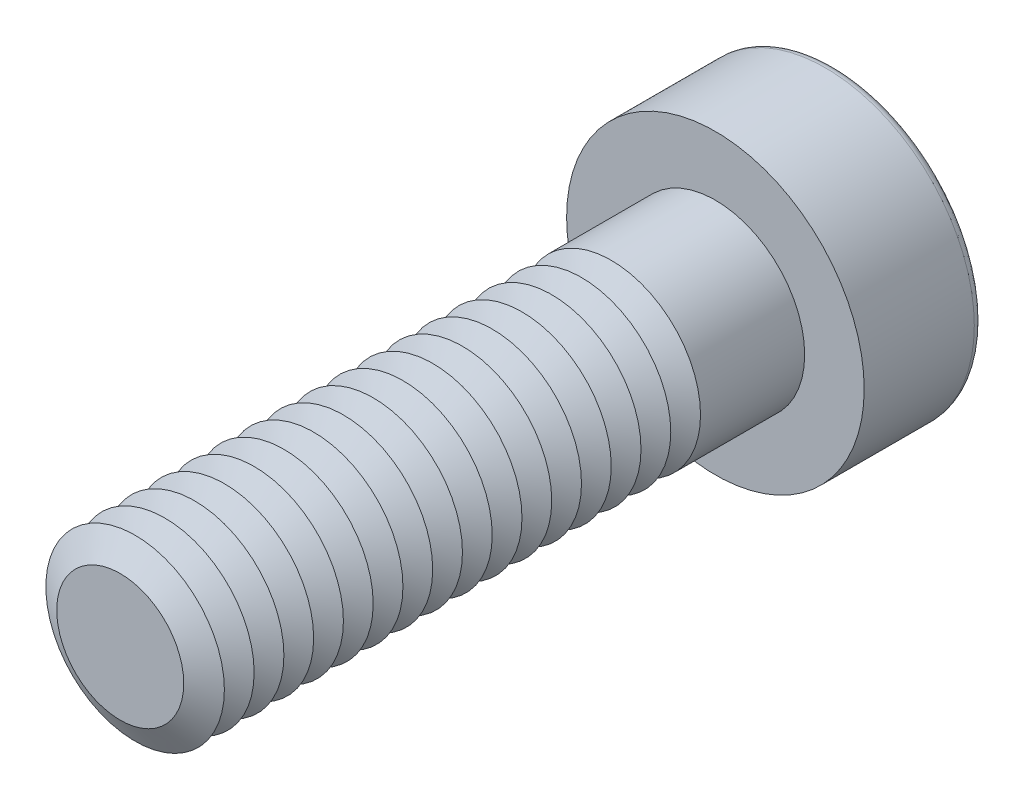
from build123d import *

# Parameters (mm, degrees)
SKETCH1_R           = 3
BOSS_EXTRUDE1_DEPTH = 20
SKETCH2_R           = 5
BOSS_EXTRUDE2_DEPTH = 4
CUT_EXTRUDE1_DEPTH  = 3
FILLET1_R           = 0.3
LPATTERN1_COUNT     = 17
LPATTERN1_PITCH     = 1


with BuildPart() as part:
    # Sketch1 → Boss-Extrude1 (new body)
    with BuildSketch(Plane.XY):
        Circle(SKETCH1_R)
    extrude(amount=BOSS_EXTRUDE1_DEPTH)

    # Sketch2 → Boss-Extrude2 (add)
    with BuildSketch(Plane(origin=(0, 0, 0), x_dir=(-1, 0, 0), z_dir=(0, 0, -1))):
        Circle(SKETCH2_R)
    extrude(amount=BOSS_EXTRUDE2_DEPTH)

    # Sketch3 → Cut-Extrude1 (cut)
    with BuildSketch(Plane(origin=(0, 0, -4), x_dir=(-1, 0, 0), z_dir=(0, 0, -1))):
        Polygon((-1.154700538, 2), (-2.309401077, 0), (-1.154700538, -2), (1.154700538, -2), (2.309401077, 0), (1.154700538, 2), align=None)
    extrude(amount=-CUT_EXTRUDE1_DEPTH, mode=Mode.SUBTRACT)

    # Fillet1
    fillet1_edges = [part.edges().sort_by_distance(p)[0] for p in [
        (5, 0, -4),
    ]]
    fillet(fillet1_edges, radius=FILLET1_R)

    # Cut-Extrude2 cone 1 section (on through the dimple's axis) → Cut-Extrude2 (revolve, cut)
    with BuildSketch(Plane(origin=(0, 0, -1), x_dir=(0, 1, 0), z_dir=(1, 0, 0))):
        Polygon((0, 0), (2, 0), (0, 1.154700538), align=None)
    revolve(axis=Axis((0, 0, -1), (0, 0, 1)), mode=Mode.SUBTRACT)

    # Cut-Extrude3 cone 1 section (on through the dimple's axis) → Cut-Extrude3 (revolve, cut)
    with BuildSketch(Plane(origin=(0, 0, -4), x_dir=(0, 1, 0), z_dir=(1, 0, 0))):
        Polygon((0, 0), (2.309401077, 0), (0, 0.618802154), align=None)
    revolve(axis=Axis((0, 0, -4), (0, 0, 1)), mode=Mode.SUBTRACT)

    # Sketch7 → Cut-Revolve1 (revolve, cut)
    with BuildSketch(Plane(origin=(0, 0, 0), x_dir=(0, 0, -1), z_dir=(1, 0, 0)), mode=Mode.PRIVATE) as cut_revolve1_sk:
        Polygon((-20, 2.133974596), (-19.5, 3), (-20.5, 3), align=None)
    cut_revolve1 = revolve(cut_revolve1_sk.sketch.rotate(Axis((0, 0, 20), (0, 0, -1)), 90), axis=Axis((0, 0, 20), (0, 0, -1)), mode=Mode.SUBTRACT)

    # LPattern1: Cut-Revolve1 ×17
    with Locations(*[(0, 0, -i * LPATTERN1_PITCH) for i in range(1, LPATTERN1_COUNT)]):
        add(cut_revolve1, mode=Mode.SUBTRACT)


solid = part.part
